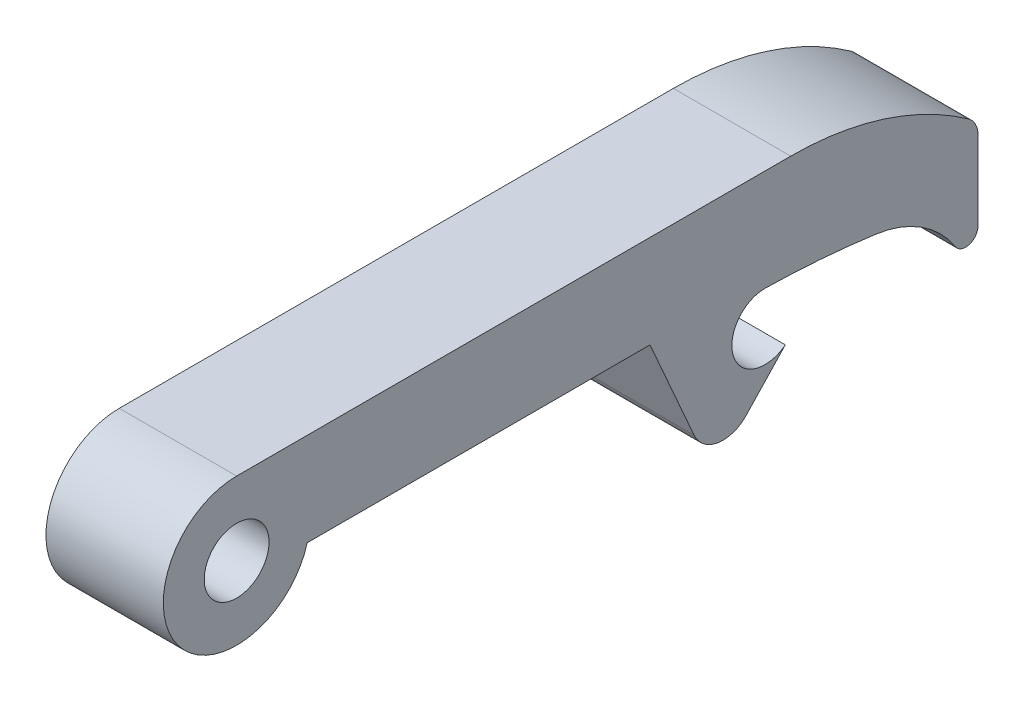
from build123d import *

# Parameters (mm, degrees)
EXTRUDE1_DEPTH     = 31.75
SKETCH3_R          = 17.536169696
CUT_EXTRUDE1_DEPTH = 345.898309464


with BuildPart() as part:
    # Sketch1 → Extrude1 (new, symmetric)
    with BuildSketch(Plane(origin=(0, 0, 0), x_dir=(0, 0, -1), z_dir=(1, 0, 0))):
        with BuildLine():
            Line((-286.195239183, 21.378739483), (13.620067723, 21.378739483))
            ThreePointArc((13.620067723, 21.378739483), (64.094534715, 13.52893685), (109.801107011, -9.27896679))
            ThreePointArc((109.801107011, -9.27896679), (113.591220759, -13.641995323), (114.956088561, -19.257876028))
            Line((114.956088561, -19.257876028), (114.956088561, -61.971704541))
            ThreePointArc((114.956088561, -61.971704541), (110.187080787, -68.350189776), (102.720112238, -65.580191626))
            ThreePointArc((102.720112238, -65.580191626), (84.244901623, -47.228515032), (59.797785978, -38.258789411))
            ThreePointArc((59.797785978, -38.258789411), (29.967376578, -35.056370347), (0, -33.619306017))
            ThreePointArc((0, -33.619306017), (-17.28683713, -57.168897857), (10.689369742, -65.580191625))
            Line((10.689369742, -65.580191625), (-10.522323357, -88.078959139))
            ThreePointArc((-10.522323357, -88.078959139), (-25.908780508, -93.211279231), (-38.684417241, -83.217937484))
            Line((-38.684417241, -83.217937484), (-62.523647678, -28.979822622))
            Line((-62.523647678, -28.979822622), (-247.993378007, -28.979822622))
            ThreePointArc((-247.993378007, -28.979822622), (-317.799696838, -42.265504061), (-286.195239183, 21.378739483))
        make_face()
    extrude(amount=EXTRUDE1_DEPTH, both=True)

    # Sketch3 → Cut-Extrude1 (cut, through all)
    with BuildSketch(Plane(origin=(31.75, 0, 0), x_dir=(0, 0, -1), z_dir=(1, 0, 0))):
        with Locations((-286.195239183, -18.29045288)):
            Circle(SKETCH3_R)
    extrude(amount=-CUT_EXTRUDE1_DEPTH, mode=Mode.SUBTRACT)


solid = part.part
